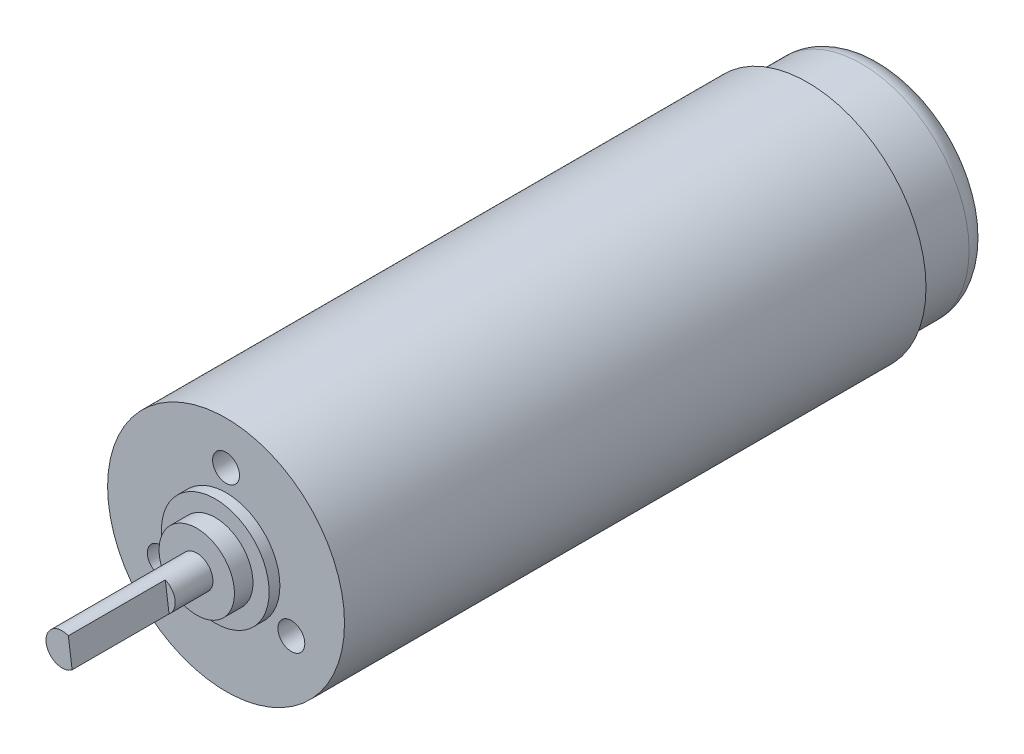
from build123d import *

# Parameters (mm, degrees)
SKETCH1_R               = 10
BOSS_EXTRUDE1_DEPTH     = 7
SKETCH2_R               = 11
BOSS_EXTRUDE2_DEPTH     = 54
SKETCH3_R               = 5
BOSS_EXTRUDE4_DEPTH     = 1
SKETCH5_R               = 3.5
BOSS_EXTRUDE5_DEPTH     = 1.72
SKETCH6_R               = 1.5
BOSS_EXTRUDE6_DEPTH     = 12.5
CUT_EXTRUDE1_DEPTH      = 78.79131314
CUT_EXTRUDE1_DEPTH_BACK = 9
SKETCH18_R              = 1.25
CUT_EXTRUDE2_DEPTH      = 9
CIRPATTERN1_COUNT       = 3
FILLET1_R               = 2


with BuildPart() as part:
    # Sketch1 → Boss-Extrude1 (new body)
    with BuildSketch(Plane.XY):
        Circle(SKETCH1_R)
    extrude(amount=BOSS_EXTRUDE1_DEPTH)

    # Sketch2 → Boss-Extrude2 (add)
    with BuildSketch(Plane.XY.offset(7)):
        Circle(SKETCH2_R)
    extrude(amount=BOSS_EXTRUDE2_DEPTH)

    # Sketch3 → Boss-Extrude4 (add)
    with BuildSketch(Plane.XY.offset(61)):
        Circle(SKETCH3_R)
    extrude(amount=BOSS_EXTRUDE4_DEPTH)

    # Sketch5 → Boss-Extrude5 (add)
    with BuildSketch(Plane.XY.offset(62)):
        Circle(SKETCH5_R)
    extrude(amount=BOSS_EXTRUDE5_DEPTH)

    # Sketch6 → Boss-Extrude6 (add)
    with BuildSketch(Plane.XY.offset(63.72)):
        Circle(SKETCH6_R)
    extrude(amount=BOSS_EXTRUDE6_DEPTH)

    # Sketch17 → Cut-Extrude1 (cut, two sides: drawn at the far end of the back side and taken through both)
    with BuildSketch(Plane.XY.offset(76.22).offset(-CUT_EXTRUDE1_DEPTH_BACK)):
        Polygon((-5.420596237, 45.068969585), (0.575645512, 1.385147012), (0.927585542, -1.178806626), (6.923827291, -44.862629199), (94.291472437, -32.870145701), (81.947048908, 57.061453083), align=None)
    extrude(amount=CUT_EXTRUDE1_DEPTH + CUT_EXTRUDE1_DEPTH_BACK, mode=Mode.SUBTRACT)

    # Sketch18 → Cut-Extrude2 (cut)
    with BuildSketch(Plane.XY.offset(61)):
        with Locations((0, 7)):
            Circle(SKETCH18_R)
    cut_extrude2 = extrude(amount=-CUT_EXTRUDE2_DEPTH, mode=Mode.SUBTRACT)

    # CirPattern1: Cut-Extrude2 ×3 about axis
    cirpattern1_axis = Axis((0, 0, 0), (0, 0, 1))
    for i in range(1, CIRPATTERN1_COUNT):
        add(cut_extrude2.rotate(cirpattern1_axis, i * 360 / CIRPATTERN1_COUNT), mode=Mode.SUBTRACT)

    # Fillet1
    fillet1_edges = [part.edges().sort_by_distance(p)[0] for p in [
        (-10, 0, 0),
    ]]
    fillet(fillet1_edges, radius=FILLET1_R)


solid = part.part
